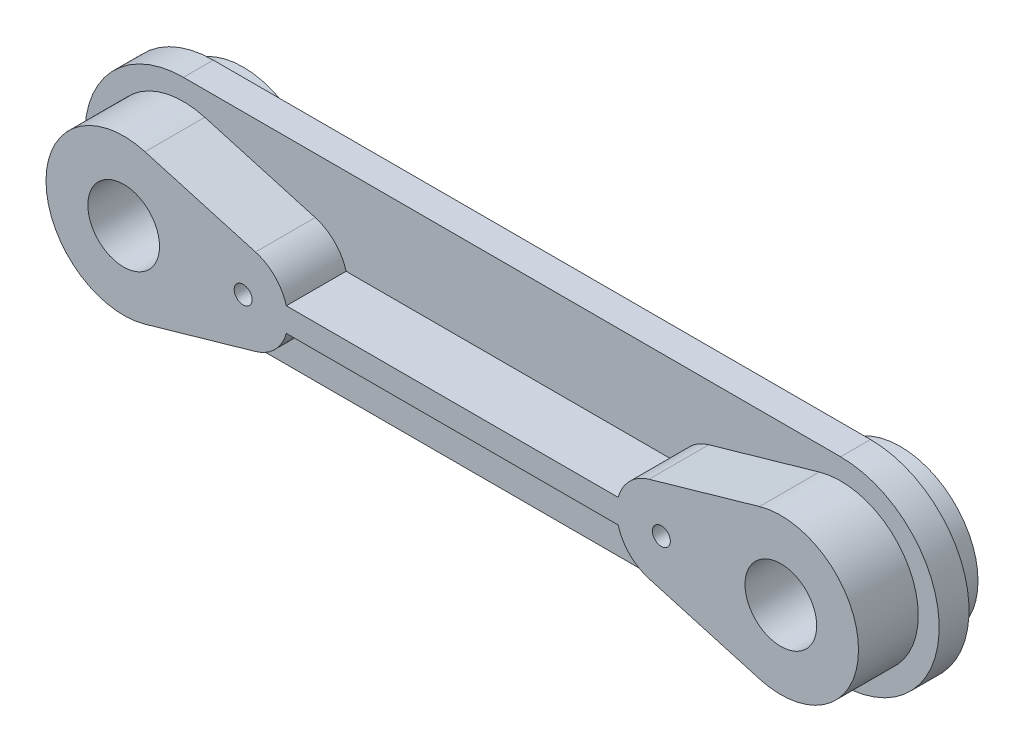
from build123d import *

# Parameters (mm, degrees)
EXTRUDE_1_DEPTH     = 10
EXTRUDE_2_DEPTH     = 20
EXTRUDE_START       = 10
SKETCH_3_R          = 26
EXTRUDE_3_DEPTH     = 10
SKETCH_4_R          = 12
SKETCH_4_R_2        = 3
CUT_EXTRUDE_1_DEPTH = 259.259559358


with BuildPart() as part:
    # Sketch 1 → Extrude 1 (new body)
    with BuildSketch(Plane.XY):
        with BuildLine():
            Line((0, 33), (220, 33))
            ThreePointArc((220, 33), (253, 0), (220, -33))
            Line((220, -33), (0, -33))
            ThreePointArc((0, -33), (-33, 0), (0, 33))
        make_face()
    extrude(amount=EXTRUDE_1_DEPTH)

    # Sketch 2 → Extrude 2 (add)
    with BuildSketch(Plane.XY.offset(10)):
        with BuildLine():
            Line((44.125, 14.421663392), (7.15, 24.99754988))
            ThreePointArc((7.15, 24.99754988), (-26, 0), (7.15, -24.99754988))
            Line((7.15, -24.99754988), (44.125, -14.421663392))
            ThreePointArc((44.125, -14.421663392), (50.652412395, -10.560592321), (54.456832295, -4))
            Line((54.456832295, -4), (165.543167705, -4))
            ThreePointArc((165.543167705, -4), (169.347587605, -10.560592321), (175.875, -14.421663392))
            Line((175.875, -14.421663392), (212.85, -24.99754988))
            ThreePointArc((212.85, -24.99754988), (246, 0), (212.85, 24.99754988))
            Line((212.85, 24.99754988), (175.875, 14.421663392))
            ThreePointArc((175.875, 14.421663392), (169.347587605, 10.560592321), (165.543167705, 4))
            Line((165.543167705, 4), (54.456832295, 4))
            ThreePointArc((54.456832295, 4), (50.652412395, 10.560592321), (44.125, 14.421663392))
        make_face()
    extrude(amount=EXTRUDE_2_DEPTH)

    # Sketch 3 → Extrude 3 (add)
    with BuildSketch(Plane(origin=(0, 0, 0), x_dir=(-1, 0, 0), z_dir=(0, 0, -1)).offset(EXTRUDE_START)):
        with Locations(Location((-220, 0, 0), (0, 0, 180))):
            Circle(SKETCH_3_R)
        with Locations(Location((0, 0, 0), (0, 0, 180))):
            Circle(SKETCH_3_R)
    extrude(amount=-EXTRUDE_3_DEPTH)

    # Sketch 4 → Cut-Extrude 1 (cut, through all)
    with BuildSketch(Plane.XY.offset(30)):
        Circle(SKETCH_4_R)
        with Locations((40, 0)):
            Circle(SKETCH_4_R_2)
        with Locations((220, 0)):
            Circle(SKETCH_4_R)
        with Locations((180, 0)):
            Circle(SKETCH_4_R_2)
    extrude(amount=-CUT_EXTRUDE_1_DEPTH, mode=Mode.SUBTRACT)


solid = part.part
